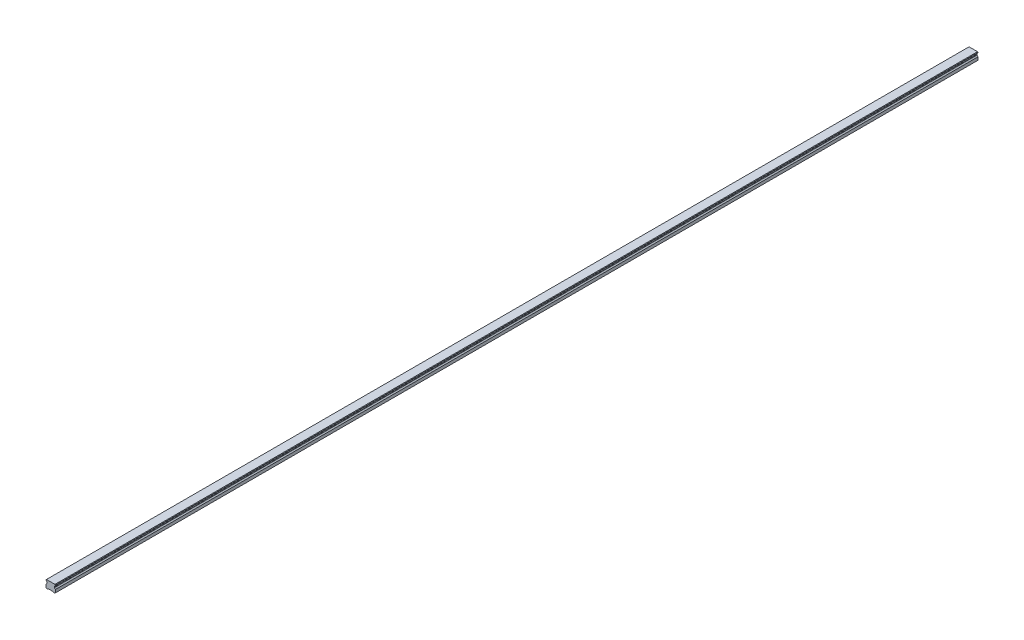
from build123d import *

# Parameters (mm, degrees)
SKETCH1_W           = 20
SKETCH1_H           = 16.3
BOSS_EXTRUDE1_DEPTH = 980
CUT_EXTRUDE1_DEPTH  = 1961.093286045
CHAMFER1_SIZE       = 1
FILLET1_R           = 1
CUT_EXTRUDE2_DEPTH  = 1961.093286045
SKETCH5_R           = 3
SKETCH5_R_2         = 2.5
CUT_EXTRUDE5_DEPTH  = 10
SKETCH5_2_R         = 2.5
CUT_EXTRUDE6_DEPTH  = 13
LPATTERN2_COUNT     = 33
LPATTERN2_PITCH     = 60


with BuildPart() as part:
    # Sketch1 → Boss-Extrude1 (new, symmetric)
    with BuildSketch(Plane.XY):
        with Locations((0, 8.15)):
            Rectangle(SKETCH1_W, SKETCH1_H)
    extrude(amount=BOSS_EXTRUDE1_DEPTH, both=True)

    # Sketch2 → Cut-Extrude1 (cut, through all)
    with BuildSketch(Plane.XY.offset(980)):
        Polygon((-10, 14.3), (-10, 7.3), (-7.666666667, 9.633333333), (-7.666666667, 11.966666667), align=None)
        Polygon((7.666666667, 11.966666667), (10, 14.3), (10, 7.3), (7.666666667, 9.633333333), align=None)
    extrude(amount=-CUT_EXTRUDE1_DEPTH, mode=Mode.SUBTRACT)

    # Chamfer1
    chamfer1_edges = [part.edges().sort_by_distance(p)[0] for p in [
        (-10, 16.3, 0),
        (10, 16.3, 0),
        (10, 0, 0),
        (-10, 0, 0),
    ]]
    chamfer(chamfer1_edges, length=CHAMFER1_SIZE)

    # Fillet1
    fillet1_edges = [part.edges().sort_by_distance(p)[0] for p in [
        (-7.666666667, 11.966666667, 0),
        (-7.666666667, 9.633333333, 0),
        (7.666666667, 9.633333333, 0),
        (7.666666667, 11.966666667, 0),
    ]]
    fillet(fillet1_edges, radius=FILLET1_R)

    # Sketch3 → Cut-Extrude2 (cut, through all)
    with BuildSketch(Plane.XY.offset(980)):
        Polygon((-6, 0), (-5, 1), (5, 1), (6, 0), align=None)
    extrude(amount=-CUT_EXTRUDE2_DEPTH, mode=Mode.SUBTRACT)

    # Sketch5 → Cut-Extrude5 (cut)
    with BuildSketch(Plane.XZ.offset(-1)):
        with Locations(Location((0, 960, 0), (0, 0, 270))):
            Circle(SKETCH5_R)
        with Locations(Location((0, 960, 0), (0, 0, 270))):
            Circle(SKETCH5_R_2, mode=Mode.SUBTRACT)
    cut_extrude5 = extrude(amount=-CUT_EXTRUDE5_DEPTH, mode=Mode.SUBTRACT)

    # Sketch5_2 → Cut-Extrude6 (cut)
    with BuildSketch(Plane.XZ.offset(-1)):
        with Locations(Location((0, 960, 0), (0, 0, 270))):
            Circle(SKETCH5_2_R)
    cut_extrude6 = extrude(amount=-CUT_EXTRUDE6_DEPTH, mode=Mode.SUBTRACT)

    # Cut-Extrude7 cone 1 section (on through the dimple's axis) → Cut-Extrude7 (revolve, cut)
    with BuildSketch(Plane(origin=(0, 14, 960), x_dir=(0, 0, -1), z_dir=(1, 0, 0))):
        Polygon((0, 0), (2.5, 0), (0, 1.443375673), align=None)
    cut_extrude7 = revolve(axis=Axis((0, 14, 960), (0, 1, 0)), mode=Mode.SUBTRACT)

    # LPattern2: Cut-Extrude5, Cut-Extrude6, Cut-Extrude7 ×33
    with Locations(*[(0, 0, -i * LPATTERN2_PITCH) for i in range(1, LPATTERN2_COUNT)]):
        add(cut_extrude5, mode=Mode.SUBTRACT)
        add(cut_extrude6, mode=Mode.SUBTRACT)
        add(cut_extrude7, mode=Mode.SUBTRACT)


solid = part.part
